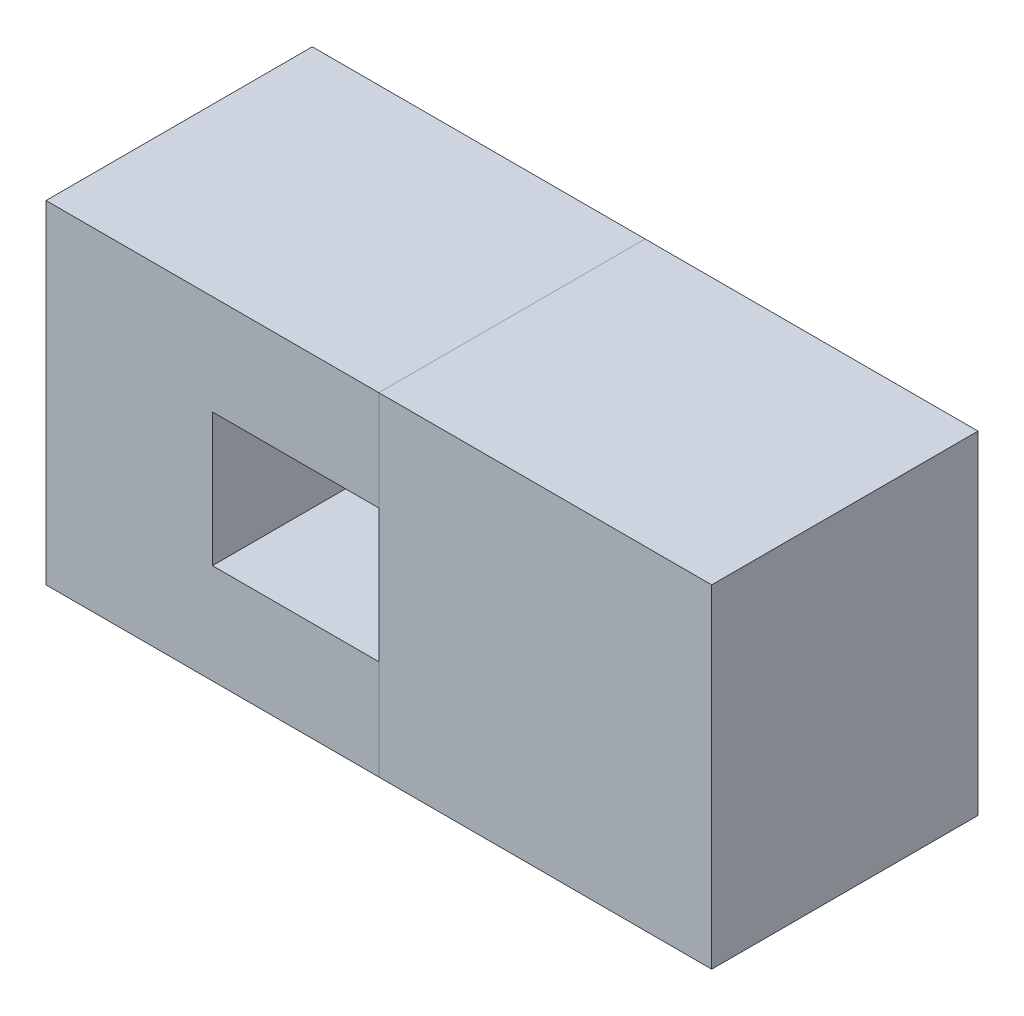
ISO-10303-21;
HEADER;
FILE_DESCRIPTION(('STEP AP214'),'2;1');
FILE_NAME('part.step','',(''),(''),'','','');
FILE_SCHEMA(('AUTOMOTIVE_DESIGN { 1 0 10303 214 1 1 1 1 }'));
ENDSEC;
DATA;
#1=APPLICATION_CONTEXT('core data for automotive mechanical design processes');
#2=APPLICATION_PROTOCOL_DEFINITION('international standard','automotive_design',2000,#1);
#3=PRODUCT_CONTEXT('',#1,'mechanical');
#4=PRODUCT('Part','Part','',(#3));
#5=PRODUCT_RELATED_PRODUCT_CATEGORY('part','',(#4));
#6=PRODUCT_DEFINITION_FORMATION('','',#4);
#7=PRODUCT_DEFINITION_CONTEXT('part definition',#1,'design');
#8=PRODUCT_DEFINITION('design','',#6,#7);
#9=PRODUCT_DEFINITION_SHAPE('','',#8);
#10=(LENGTH_UNIT() NAMED_UNIT(*) SI_UNIT(.MILLI.,.METRE.));
#11=(NAMED_UNIT(*) PLANE_ANGLE_UNIT() SI_UNIT($,.RADIAN.));
#12=(NAMED_UNIT(*) SI_UNIT($,.STERADIAN.) SOLID_ANGLE_UNIT());
#13=UNCERTAINTY_MEASURE_WITH_UNIT(LENGTH_MEASURE(1.E-05),#10,'distance_accuracy_value','');
#14=(GEOMETRIC_REPRESENTATION_CONTEXT(3) GLOBAL_UNCERTAINTY_ASSIGNED_CONTEXT((#13)) GLOBAL_UNIT_ASSIGNED_CONTEXT((#10,
#11,#12)) REPRESENTATION_CONTEXT('',''));
#15=CARTESIAN_POINT('',(0.,0.,0.));
#16=DIRECTION('',(0.,0.,1.));
#17=DIRECTION('',(1.,0.,0.));
#18=AXIS2_PLACEMENT_3D('',#15,#16,#17);
#19=CARTESIAN_POINT('',(50.,15.,0.));
#20=DIRECTION('',(-1.,0.,0.));
#21=DIRECTION('',(0.,0.,1.));
#22=AXIS2_PLACEMENT_3D('',#19,#20,#21);
#23=PLANE('',#22);
#24=DIRECTION('',(0.,0.,1.));
#25=VECTOR('',#24,1.);
#26=CARTESIAN_POINT('',(50.,0.,40.));
#27=LINE('',#26,#25);
#28=CARTESIAN_POINT('',(50.,0.,0.));
#29=VERTEX_POINT('',#28);
#30=CARTESIAN_POINT('',(50.,0.,40.));
#31=VERTEX_POINT('',#30);
#32=EDGE_CURVE('E100',#29,#31,#27,.T.);
#33=ORIENTED_EDGE('',*,*,#32,.T.);
#34=DIRECTION('',(0.,1.,0.));
#35=VECTOR('',#34,1.);
#36=CARTESIAN_POINT('',(50.,35.,40.));
#37=LINE('',#36,#35);
#38=CARTESIAN_POINT('',(50.,50.,40.));
#39=VERTEX_POINT('',#38);
#40=EDGE_CURVE('E50',#31,#39,#37,.T.);
#41=ORIENTED_EDGE('',*,*,#40,.T.);
#42=DIRECTION('',(0.,0.,-1.));
#43=VECTOR('',#42,1.);
#44=CARTESIAN_POINT('',(50.,50.,40.));
#45=LINE('',#44,#43);
#46=CARTESIAN_POINT('',(50.,50.,0.));
#47=VERTEX_POINT('',#46);
#48=EDGE_CURVE('E96',#39,#47,#45,.T.);
#49=ORIENTED_EDGE('',*,*,#48,.T.);
#50=DIRECTION('',(0.,1.,0.));
#51=VECTOR('',#50,1.);
#52=CARTESIAN_POINT('',(50.,35.,0.));
#53=LINE('',#52,#51);
#54=EDGE_CURVE('E12',#29,#47,#53,.T.);
#55=ORIENTED_EDGE('',*,*,#54,.F.);
#56=EDGE_LOOP('',(#33,#41,#49,#55));
#57=FACE_BOUND('',#56,.T.);
#58=ADVANCED_FACE('F40',(#57),#23,.T.);
#59=CARTESIAN_POINT('',(0.,50.,40.));
#60=DIRECTION('',(0.,0.,-1.));
#61=DIRECTION('',(-1.,0.,0.));
#62=AXIS2_PLACEMENT_3D('',#59,#60,#61);
#63=PLANE('',#62);
#64=ORIENTED_EDGE('',*,*,#40,.F.);
#65=DIRECTION('',(1.,0.,0.));
#66=VECTOR('',#65,1.);
#67=CARTESIAN_POINT('',(0.,0.,40.));
#68=LINE('',#67,#66);
#69=CARTESIAN_POINT('',(100.,0.,40.));
#70=VERTEX_POINT('',#69);
#71=EDGE_CURVE('E99',#31,#70,#68,.T.);
#72=ORIENTED_EDGE('',*,*,#71,.T.);
#73=DIRECTION('',(0.,1.,0.));
#74=VECTOR('',#73,1.);
#75=CARTESIAN_POINT('',(100.,0.,40.));
#76=LINE('',#75,#74);
#77=CARTESIAN_POINT('',(100.,50.,40.));
#78=VERTEX_POINT('',#77);
#79=EDGE_CURVE('E70',#70,#78,#76,.T.);
#80=ORIENTED_EDGE('',*,*,#79,.T.);
#81=DIRECTION('',(-1.,0.,0.));
#82=VECTOR('',#81,1.);
#83=CARTESIAN_POINT('',(0.,50.,40.));
#84=LINE('',#83,#82);
#85=EDGE_CURVE('E106',#78,#39,#84,.T.);
#86=ORIENTED_EDGE('',*,*,#85,.T.);
#87=EDGE_LOOP('',(#64,#72,#80,#86));
#88=FACE_BOUND('',#87,.T.);
#89=ADVANCED_FACE('F119',(#88),#63,.F.);
#90=CARTESIAN_POINT('',(0.,50.,0.));
#91=DIRECTION('',(0.,0.,-1.));
#92=DIRECTION('',(-1.,0.,0.));
#93=AXIS2_PLACEMENT_3D('',#90,#91,#92);
#94=PLANE('',#93);
#95=DIRECTION('',(1.,0.,0.));
#96=VECTOR('',#95,1.);
#97=CARTESIAN_POINT('',(0.,0.,0.));
#98=LINE('',#97,#96);
#99=CARTESIAN_POINT('',(100.,0.,0.));
#100=VERTEX_POINT('',#99);
#101=EDGE_CURVE('E44',#29,#100,#98,.T.);
#102=ORIENTED_EDGE('',*,*,#101,.F.);
#103=ORIENTED_EDGE('',*,*,#54,.T.);
#104=DIRECTION('',(-1.,0.,0.));
#105=VECTOR('',#104,1.);
#106=CARTESIAN_POINT('',(0.,50.,0.));
#107=LINE('',#106,#105);
#108=CARTESIAN_POINT('',(100.,50.,0.));
#109=VERTEX_POINT('',#108);
#110=EDGE_CURVE('E87',#109,#47,#107,.T.);
#111=ORIENTED_EDGE('',*,*,#110,.F.);
#112=DIRECTION('',(0.,1.,0.));
#113=VECTOR('',#112,1.);
#114=CARTESIAN_POINT('',(100.,0.,0.));
#115=LINE('',#114,#113);
#116=EDGE_CURVE('E98',#100,#109,#115,.T.);
#117=ORIENTED_EDGE('',*,*,#116,.F.);
#118=EDGE_LOOP('',(#102,#103,#111,#117));
#119=FACE_BOUND('',#118,.T.);
#120=ADVANCED_FACE('F85',(#119),#94,.T.);
#121=CARTESIAN_POINT('',(0.,0.,40.));
#122=DIRECTION('',(0.,1.,0.));
#123=DIRECTION('',(-1.,0.,0.));
#124=AXIS2_PLACEMENT_3D('',#121,#122,#123);
#125=PLANE('',#124);
#126=ORIENTED_EDGE('',*,*,#32,.F.);
#127=ORIENTED_EDGE('',*,*,#101,.T.);
#128=DIRECTION('',(0.,0.,-1.));
#129=VECTOR('',#128,1.);
#130=CARTESIAN_POINT('',(100.,0.,40.));
#131=LINE('',#130,#129);
#132=EDGE_CURVE('E102',#70,#100,#131,.T.);
#133=ORIENTED_EDGE('',*,*,#132,.F.);
#134=ORIENTED_EDGE('',*,*,#71,.F.);
#135=EDGE_LOOP('',(#126,#127,#133,#134));
#136=FACE_BOUND('',#135,.T.);
#137=ADVANCED_FACE('F42',(#136),#125,.F.);
#138=CARTESIAN_POINT('',(0.,50.,40.));
#139=DIRECTION('',(0.,-1.,0.));
#140=DIRECTION('',(0.,0.,-1.));
#141=AXIS2_PLACEMENT_3D('',#138,#139,#140);
#142=PLANE('',#141);
#143=ORIENTED_EDGE('',*,*,#48,.F.);
#144=ORIENTED_EDGE('',*,*,#85,.F.);
#145=DIRECTION('',(0.,0.,-1.));
#146=VECTOR('',#145,1.);
#147=CARTESIAN_POINT('',(100.,50.,40.));
#148=LINE('',#147,#146);
#149=EDGE_CURVE('E97',#78,#109,#148,.T.);
#150=ORIENTED_EDGE('',*,*,#149,.T.);
#151=ORIENTED_EDGE('',*,*,#110,.T.);
#152=EDGE_LOOP('',(#143,#144,#150,#151));
#153=FACE_BOUND('',#152,.T.);
#154=ADVANCED_FACE('F94',(#153),#142,.F.);
#155=CARTESIAN_POINT('',(100.,0.,40.));
#156=DIRECTION('',(-1.,0.,0.));
#157=DIRECTION('',(0.,0.,1.));
#158=AXIS2_PLACEMENT_3D('',#155,#156,#157);
#159=PLANE('',#158);
#160=ORIENTED_EDGE('',*,*,#116,.T.);
#161=ORIENTED_EDGE('',*,*,#149,.F.);
#162=ORIENTED_EDGE('',*,*,#79,.F.);
#163=ORIENTED_EDGE('',*,*,#132,.T.);
#164=EDGE_LOOP('',(#160,#161,#162,#163));
#165=FACE_BOUND('',#164,.T.);
#166=ADVANCED_FACE('F112',(#165),#159,.F.);
#167=CLOSED_SHELL('',(#58,#89,#120,#137,#154,#166));
#168=MANIFOLD_SOLID_BREP('B2',#167);
#169=CARTESIAN_POINT('',(50.,15.,0.));
#170=DIRECTION('',(-1.,0.,0.));
#171=DIRECTION('',(0.,0.,1.));
#172=AXIS2_PLACEMENT_3D('',#169,#170,#171);
#173=PLANE('',#172);
#174=DIRECTION('',(0.,0.,1.));
#175=VECTOR('',#174,1.);
#176=CARTESIAN_POINT('',(50.,0.,40.));
#177=LINE('',#176,#175);
#178=CARTESIAN_POINT('',(50.,0.,0.));
#179=VERTEX_POINT('',#178);
#180=CARTESIAN_POINT('',(50.,0.,40.));
#181=VERTEX_POINT('',#180);
#182=EDGE_CURVE('E172',#179,#181,#177,.T.);
#183=ORIENTED_EDGE('',*,*,#182,.F.);
#184=DIRECTION('',(0.,1.,0.));
#185=VECTOR('',#184,1.);
#186=CARTESIAN_POINT('',(50.,50.,0.));
#187=LINE('',#186,#185);
#188=CARTESIAN_POINT('',(50.,15.,0.));
#189=VERTEX_POINT('',#188);
#190=EDGE_CURVE('E293',#179,#189,#187,.T.);
#191=ORIENTED_EDGE('',*,*,#190,.T.);
#192=DIRECTION('',(0.,0.,-1.));
#193=VECTOR('',#192,1.);
#194=CARTESIAN_POINT('',(50.,15.,40.));
#195=LINE('',#194,#193);
#196=CARTESIAN_POINT('',(50.,15.,40.));
#197=VERTEX_POINT('',#196);
#198=EDGE_CURVE('E255',#197,#189,#195,.T.);
#199=ORIENTED_EDGE('',*,*,#198,.F.);
#200=DIRECTION('',(0.,1.,0.));
#201=VECTOR('',#200,1.);
#202=CARTESIAN_POINT('',(50.,50.,40.));
#203=LINE('',#202,#201);
#204=EDGE_CURVE('E259',#181,#197,#203,.T.);
#205=ORIENTED_EDGE('',*,*,#204,.F.);
#206=EDGE_LOOP('',(#183,#191,#199,#205));
#207=FACE_BOUND('',#206,.T.);
#208=ADVANCED_FACE('F169',(#207),#173,.F.);
#209=DIRECTION('',(0.,0.,-1.));
#210=VECTOR('',#209,1.);
#211=CARTESIAN_POINT('',(50.,35.,40.));
#212=LINE('',#211,#210);
#213=CARTESIAN_POINT('',(50.,35.,40.));
#214=VERTEX_POINT('',#213);
#215=CARTESIAN_POINT('',(50.,35.,0.));
#216=VERTEX_POINT('',#215);
#217=EDGE_CURVE('E38',#214,#216,#212,.T.);
#218=ORIENTED_EDGE('',*,*,#217,.T.);
#219=CARTESIAN_POINT('',(50.,50.,0.));
#220=VERTEX_POINT('',#219);
#221=EDGE_CURVE('E177',#216,#220,#187,.T.);
#222=ORIENTED_EDGE('',*,*,#221,.T.);
#223=DIRECTION('',(0.,0.,-1.));
#224=VECTOR('',#223,1.);
#225=CARTESIAN_POINT('',(50.,50.,40.));
#226=LINE('',#225,#224);
#227=CARTESIAN_POINT('',(50.,50.,40.));
#228=VERTEX_POINT('',#227);
#229=EDGE_CURVE('E291',#228,#220,#226,.T.);
#230=ORIENTED_EDGE('',*,*,#229,.F.);
#231=EDGE_CURVE('E190',#214,#228,#203,.T.);
#232=ORIENTED_EDGE('',*,*,#231,.F.);
#233=EDGE_LOOP('',(#218,#222,#230,#232));
#234=FACE_BOUND('',#233,.T.);
#235=ADVANCED_FACE('F309',(#234),#173,.F.);
#236=CARTESIAN_POINT('',(0.,0.,40.));
#237=DIRECTION('',(1.,0.,0.));
#238=DIRECTION('',(0.,1.,0.));
#239=AXIS2_PLACEMENT_3D('',#236,#237,#238);
#240=PLANE('',#239);
#241=DIRECTION('',(0.,-1.,0.));
#242=VECTOR('',#241,1.);
#243=CARTESIAN_POINT('',(0.,0.,0.));
#244=LINE('',#243,#242);
#245=CARTESIAN_POINT('',(0.,50.,0.));
#246=VERTEX_POINT('',#245);
#247=CARTESIAN_POINT('',(0.,0.,0.));
#248=VERTEX_POINT('',#247);
#249=EDGE_CURVE('E254',#246,#248,#244,.T.);
#250=ORIENTED_EDGE('',*,*,#249,.T.);
#251=DIRECTION('',(0.,0.,-1.));
#252=VECTOR('',#251,1.);
#253=CARTESIAN_POINT('',(0.,0.,40.));
#254=LINE('',#253,#252);
#255=CARTESIAN_POINT('',(0.,0.,40.));
#256=VERTEX_POINT('',#255);
#257=EDGE_CURVE('E288',#256,#248,#254,.T.);
#258=ORIENTED_EDGE('',*,*,#257,.F.);
#259=DIRECTION('',(0.,-1.,0.));
#260=VECTOR('',#259,1.);
#261=CARTESIAN_POINT('',(0.,0.,40.));
#262=LINE('',#261,#260);
#263=CARTESIAN_POINT('',(0.,50.,40.));
#264=VERTEX_POINT('',#263);
#265=EDGE_CURVE('E271',#264,#256,#262,.T.);
#266=ORIENTED_EDGE('',*,*,#265,.F.);
#267=DIRECTION('',(0.,0.,-1.));
#268=VECTOR('',#267,1.);
#269=CARTESIAN_POINT('',(0.,50.,40.));
#270=LINE('',#269,#268);
#271=EDGE_CURVE('E279',#264,#246,#270,.T.);
#272=ORIENTED_EDGE('',*,*,#271,.T.);
#273=EDGE_LOOP('',(#250,#258,#266,#272));
#274=FACE_BOUND('',#273,.T.);
#275=ADVANCED_FACE('F305',(#274),#240,.F.);
#276=CARTESIAN_POINT('',(25.,35.,40.));
#277=DIRECTION('',(1.,0.,0.));
#278=DIRECTION('',(0.,0.,-1.));
#279=AXIS2_PLACEMENT_3D('',#276,#277,#278);
#280=PLANE('',#279);
#281=DIRECTION('',(0.,-1.,0.));
#282=VECTOR('',#281,1.);
#283=CARTESIAN_POINT('',(25.,35.,0.));
#284=LINE('',#283,#282);
#285=CARTESIAN_POINT('',(25.,35.,0.));
#286=VERTEX_POINT('',#285);
#287=CARTESIAN_POINT('',(25.,15.,0.));
#288=VERTEX_POINT('',#287);
#289=EDGE_CURVE('E265',#286,#288,#284,.T.);
#290=ORIENTED_EDGE('',*,*,#289,.F.);
#291=DIRECTION('',(0.,0.,-1.));
#292=VECTOR('',#291,1.);
#293=CARTESIAN_POINT('',(25.,35.,40.));
#294=LINE('',#293,#292);
#295=CARTESIAN_POINT('',(25.,35.,40.));
#296=VERTEX_POINT('',#295);
#297=EDGE_CURVE('E242',#296,#286,#294,.T.);
#298=ORIENTED_EDGE('',*,*,#297,.F.);
#299=DIRECTION('',(0.,-1.,0.));
#300=VECTOR('',#299,1.);
#301=CARTESIAN_POINT('',(25.,35.,40.));
#302=LINE('',#301,#300);
#303=CARTESIAN_POINT('',(25.,15.,40.));
#304=VERTEX_POINT('',#303);
#305=EDGE_CURVE('E236',#296,#304,#302,.T.);
#306=ORIENTED_EDGE('',*,*,#305,.T.);
#307=DIRECTION('',(0.,0.,-1.));
#308=VECTOR('',#307,1.);
#309=CARTESIAN_POINT('',(25.,15.,40.));
#310=LINE('',#309,#308);
#311=EDGE_CURVE('E239',#304,#288,#310,.T.);
#312=ORIENTED_EDGE('',*,*,#311,.T.);
#313=EDGE_LOOP('',(#290,#298,#306,#312));
#314=FACE_BOUND('',#313,.T.);
#315=ADVANCED_FACE('F238',(#314),#280,.T.);
#316=CARTESIAN_POINT('',(0.,50.,40.));
#317=DIRECTION('',(0.,0.,-1.));
#318=DIRECTION('',(-1.,0.,0.));
#319=AXIS2_PLACEMENT_3D('',#316,#317,#318);
#320=PLANE('',#319);
#321=DIRECTION('',(1.,0.,0.));
#322=VECTOR('',#321,1.);
#323=CARTESIAN_POINT('',(0.,0.,40.));
#324=LINE('',#323,#322);
#325=EDGE_CURVE('E274',#256,#181,#324,.T.);
#326=ORIENTED_EDGE('',*,*,#325,.T.);
#327=ORIENTED_EDGE('',*,*,#204,.T.);
#328=DIRECTION('',(1.,0.,0.));
#329=VECTOR('',#328,1.);
#330=CARTESIAN_POINT('',(25.,15.,40.));
#331=LINE('',#330,#329);
#332=EDGE_CURVE('E246',#304,#197,#331,.T.);
#333=ORIENTED_EDGE('',*,*,#332,.F.);
#334=ORIENTED_EDGE('',*,*,#305,.F.);
#335=DIRECTION('',(-1.,0.,0.));
#336=VECTOR('',#335,1.);
#337=CARTESIAN_POINT('',(25.,35.,40.));
#338=LINE('',#337,#336);
#339=EDGE_CURVE('E261',#214,#296,#338,.T.);
#340=ORIENTED_EDGE('',*,*,#339,.F.);
#341=ORIENTED_EDGE('',*,*,#231,.T.);
#342=DIRECTION('',(-1.,0.,0.));
#343=VECTOR('',#342,1.);
#344=CARTESIAN_POINT('',(0.,50.,40.));
#345=LINE('',#344,#343);
#346=EDGE_CURVE('E277',#228,#264,#345,.T.);
#347=ORIENTED_EDGE('',*,*,#346,.T.);
#348=ORIENTED_EDGE('',*,*,#265,.T.);
#349=EDGE_LOOP('',(#326,#327,#333,#334,#340,#341,#347,#348));
#350=FACE_BOUND('',#349,.T.);
#351=ADVANCED_FACE('F258',(#350),#320,.F.);
#352=CARTESIAN_POINT('',(0.,50.,0.));
#353=DIRECTION('',(0.,0.,-1.));
#354=DIRECTION('',(-1.,0.,0.));
#355=AXIS2_PLACEMENT_3D('',#352,#353,#354);
#356=PLANE('',#355);
#357=ORIENTED_EDGE('',*,*,#190,.F.);
#358=DIRECTION('',(1.,0.,0.));
#359=VECTOR('',#358,1.);
#360=CARTESIAN_POINT('',(0.,0.,0.));
#361=LINE('',#360,#359);
#362=EDGE_CURVE('E282',#248,#179,#361,.T.);
#363=ORIENTED_EDGE('',*,*,#362,.F.);
#364=ORIENTED_EDGE('',*,*,#249,.F.);
#365=DIRECTION('',(-1.,0.,0.));
#366=VECTOR('',#365,1.);
#367=CARTESIAN_POINT('',(0.,50.,0.));
#368=LINE('',#367,#366);
#369=EDGE_CURVE('E275',#220,#246,#368,.T.);
#370=ORIENTED_EDGE('',*,*,#369,.F.);
#371=ORIENTED_EDGE('',*,*,#221,.F.);
#372=DIRECTION('',(-1.,0.,0.));
#373=VECTOR('',#372,1.);
#374=CARTESIAN_POINT('',(25.,35.,0.));
#375=LINE('',#374,#373);
#376=EDGE_CURVE('E247',#216,#286,#375,.T.);
#377=ORIENTED_EDGE('',*,*,#376,.T.);
#378=ORIENTED_EDGE('',*,*,#289,.T.);
#379=DIRECTION('',(1.,0.,0.));
#380=VECTOR('',#379,1.);
#381=CARTESIAN_POINT('',(25.,15.,0.));
#382=LINE('',#381,#380);
#383=EDGE_CURVE('E253',#288,#189,#382,.T.);
#384=ORIENTED_EDGE('',*,*,#383,.T.);
#385=EDGE_LOOP('',(#357,#363,#364,#370,#371,#377,#378,#384));
#386=FACE_BOUND('',#385,.T.);
#387=ADVANCED_FACE('F307',(#386),#356,.T.);
#388=CARTESIAN_POINT('',(25.,35.,40.));
#389=DIRECTION('',(0.,-1.,0.));
#390=DIRECTION('',(0.,0.,-1.));
#391=AXIS2_PLACEMENT_3D('',#388,#389,#390);
#392=PLANE('',#391);
#393=ORIENTED_EDGE('',*,*,#376,.F.);
#394=ORIENTED_EDGE('',*,*,#217,.F.);
#395=ORIENTED_EDGE('',*,*,#339,.T.);
#396=ORIENTED_EDGE('',*,*,#297,.T.);
#397=EDGE_LOOP('',(#393,#394,#395,#396));
#398=FACE_BOUND('',#397,.T.);
#399=ADVANCED_FACE('F327',(#398),#392,.T.);
#400=CARTESIAN_POINT('',(25.,15.,40.));
#401=DIRECTION('',(0.,1.,0.));
#402=DIRECTION('',(0.,0.,1.));
#403=AXIS2_PLACEMENT_3D('',#400,#401,#402);
#404=PLANE('',#403);
#405=ORIENTED_EDGE('',*,*,#383,.F.);
#406=ORIENTED_EDGE('',*,*,#311,.F.);
#407=ORIENTED_EDGE('',*,*,#332,.T.);
#408=ORIENTED_EDGE('',*,*,#198,.T.);
#409=EDGE_LOOP('',(#405,#406,#407,#408));
#410=FACE_BOUND('',#409,.T.);
#411=ADVANCED_FACE('F251',(#410),#404,.T.);
#412=CARTESIAN_POINT('',(0.,50.,40.));
#413=DIRECTION('',(0.,-1.,0.));
#414=DIRECTION('',(0.,0.,-1.));
#415=AXIS2_PLACEMENT_3D('',#412,#413,#414);
#416=PLANE('',#415);
#417=ORIENTED_EDGE('',*,*,#346,.F.);
#418=ORIENTED_EDGE('',*,*,#229,.T.);
#419=ORIENTED_EDGE('',*,*,#369,.T.);
#420=ORIENTED_EDGE('',*,*,#271,.F.);
#421=EDGE_LOOP('',(#417,#418,#419,#420));
#422=FACE_BOUND('',#421,.T.);
#423=ADVANCED_FACE('F317',(#422),#416,.F.);
#424=CARTESIAN_POINT('',(0.,0.,40.));
#425=DIRECTION('',(0.,1.,0.));
#426=DIRECTION('',(-1.,0.,0.));
#427=AXIS2_PLACEMENT_3D('',#424,#425,#426);
#428=PLANE('',#427);
#429=ORIENTED_EDGE('',*,*,#362,.T.);
#430=ORIENTED_EDGE('',*,*,#182,.T.);
#431=ORIENTED_EDGE('',*,*,#325,.F.);
#432=ORIENTED_EDGE('',*,*,#257,.T.);
#433=EDGE_LOOP('',(#429,#430,#431,#432));
#434=FACE_BOUND('',#433,.T.);
#435=ADVANCED_FACE('F298',(#434),#428,.F.);
#436=CLOSED_SHELL('',(#208,#235,#275,#315,#351,#387,#399,#411,#423,#435));
#437=MANIFOLD_SOLID_BREP('B6',#436);
#438=ADVANCED_BREP_SHAPE_REPRESENTATION('',(#18,#168,#437),#14);
#439=SHAPE_DEFINITION_REPRESENTATION(#9,#438);
ENDSEC;
END-ISO-10303-21;
